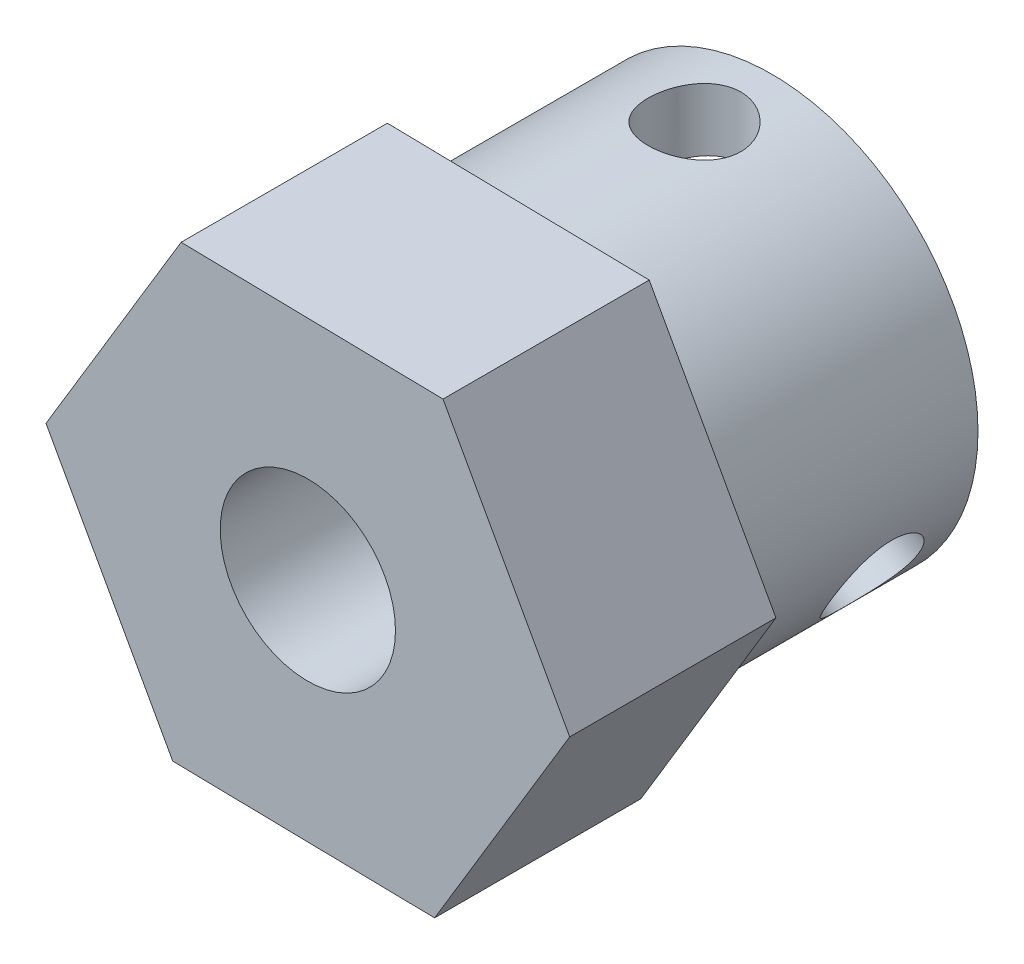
from build123d import *

# Parameters (mm, degrees)
SKETCH2_R                = 5.08
BOSS_EXTRUDE2_DEPTH      = 8.89
BOSS_EXTRUDE3_DEPTH      = 2.54
BOSS_EXTRUDE3_DEPTH_BACK = 2.54
SKETCH3_R                = 3.556
CUT_EXTRUDE3_DEPTH       = 7.874
SKETCH6_R                = 2.159
CUT_EXTRUDE4_DEPTH       = 15.28823898
SKETCH7_R                = 1.143
CUT_EXTRUDE5_DEPTH       = 13.350747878
CIRPATTERN1_COUNT        = 3


with BuildPart() as part:
    # Sketch2 → Boss-Extrude2 (new body)
    with BuildSketch(Plane.XY):
        Circle(SKETCH2_R)
    extrude(amount=-BOSS_EXTRUDE2_DEPTH)

    # Sketch5 → Boss-Extrude3 (add, two sides: drawn at the far end of the back side and taken through both)
    with BuildSketch(Plane.XY.offset(-BOSS_EXTRUDE3_DEPTH_BACK)):
        Polygon((6.451350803, -0.119992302), (3.329591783, 5.527037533), (-3.12175902, 5.647029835), (-6.451350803, 0.119992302), (-3.329591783, -5.527037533), (3.12175902, -5.647029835), align=None)
    extrude(amount=BOSS_EXTRUDE3_DEPTH + BOSS_EXTRUDE3_DEPTH_BACK)

    # Sketch3 → Cut-Extrude3 (cut)
    with BuildSketch(Plane(origin=(0, 0, -8.89), x_dir=(-1, 0, 0), z_dir=(0, 0, -1))):
        Circle(SKETCH3_R)
    extrude(amount=-CUT_EXTRUDE3_DEPTH, mode=Mode.SUBTRACT)

    # Sketch6 → Cut-Extrude4 (cut, through all)
    with BuildSketch(Plane.XY.offset(2.54)):
        Circle(SKETCH6_R)
    extrude(amount=-CUT_EXTRUDE4_DEPTH, mode=Mode.SUBTRACT)

    # Sketch7 → Cut-Extrude5 (cut, through all)
    with BuildSketch(Plane(origin=(0, 0, 0), x_dir=(1, 0, 0), z_dir=(0, 1, 0))):
        with Locations(Location((0, 6.985, 0), (0, 0, 90))):
            Circle(SKETCH7_R)
    cut_extrude5 = extrude(amount=CUT_EXTRUDE5_DEPTH, mode=Mode.SUBTRACT)

    # CirPattern1: Cut-Extrude5 ×3 about axis
    cirpattern1_axis = Axis((0, 0, -8.89), (0, 0, 1))
    for i in range(1, CIRPATTERN1_COUNT):
        add(cut_extrude5.rotate(cirpattern1_axis, i * 360 / CIRPATTERN1_COUNT), mode=Mode.SUBTRACT)


solid = part.part
